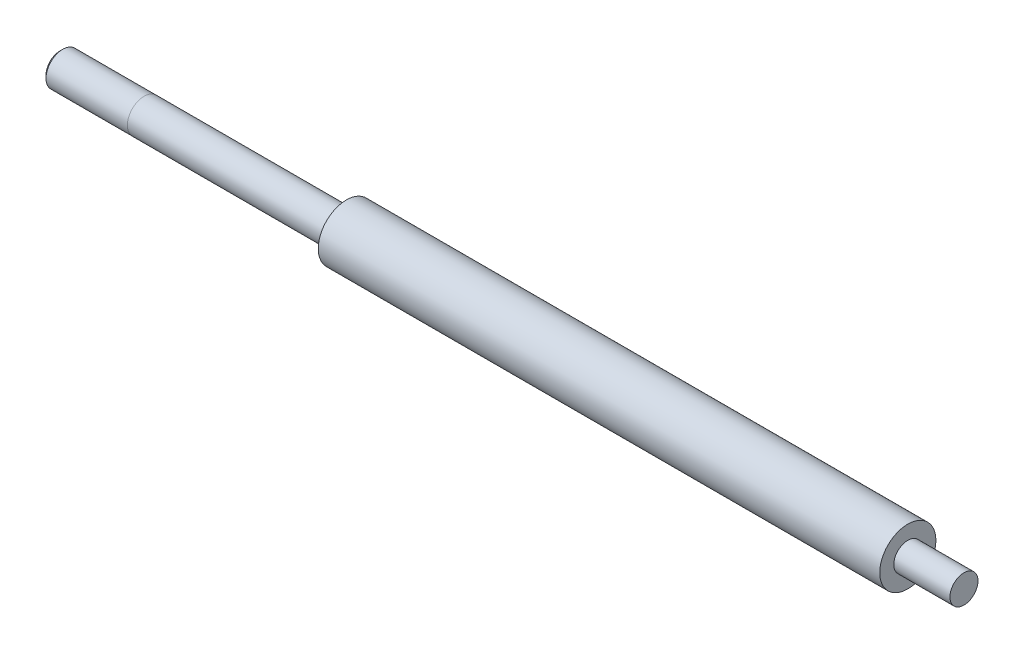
from build123d import *

# Parameters (mm, degrees)
SKETCH1_R          = 5
EXTRUDE1_DEPTH     = 100
SKETCH2_R          = 2.5
EXTRUDE2_DEPTH     = 10
SKETCH3_R          = 3
EXTRUDE3_DEPTH     = 51
SKETCH4_R          = 9.906703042
SKETCH4_R_2        = 2.99
CUT_EXTRUDE1_DEPTH = 15
CHAMFER1_SIZE      = 0.5


with BuildPart() as part:
    # Sketch1 → Extrude1 (new body)
    with BuildSketch(Plane(origin=(0, 0, 0), x_dir=(0, 0, -1), z_dir=(1, 0, 0))):
        Circle(SKETCH1_R)
    extrude(amount=EXTRUDE1_DEPTH)

    # Sketch2 → Extrude2 (add)
    with BuildSketch(Plane(origin=(100, 0, 0), x_dir=(0, 0, -1), z_dir=(1, 0, 0))):
        Circle(SKETCH2_R)
    extrude(amount=EXTRUDE2_DEPTH)

    # Sketch3 → Extrude3 (add)
    with BuildSketch(Plane.ZY):
        with Locations(Location((0, 0, 0), (0, 0, 180))):
            Circle(SKETCH3_R)
    extrude(amount=EXTRUDE3_DEPTH)

    # Sketch4 → Cut-Extrude1 (cut)
    with BuildSketch(Plane.ZY.offset(51)):
        Circle(SKETCH4_R)
        Circle(SKETCH4_R_2, mode=Mode.SUBTRACT)
    extrude(amount=-CUT_EXTRUDE1_DEPTH, mode=Mode.SUBTRACT)

    # Chamfer1
    chamfer1_edges = [part.edges().sort_by_distance(p)[0] for p in [
        (-51, 0, -2.99),
    ]]
    chamfer(chamfer1_edges, length=CHAMFER1_SIZE)


solid = part.part
